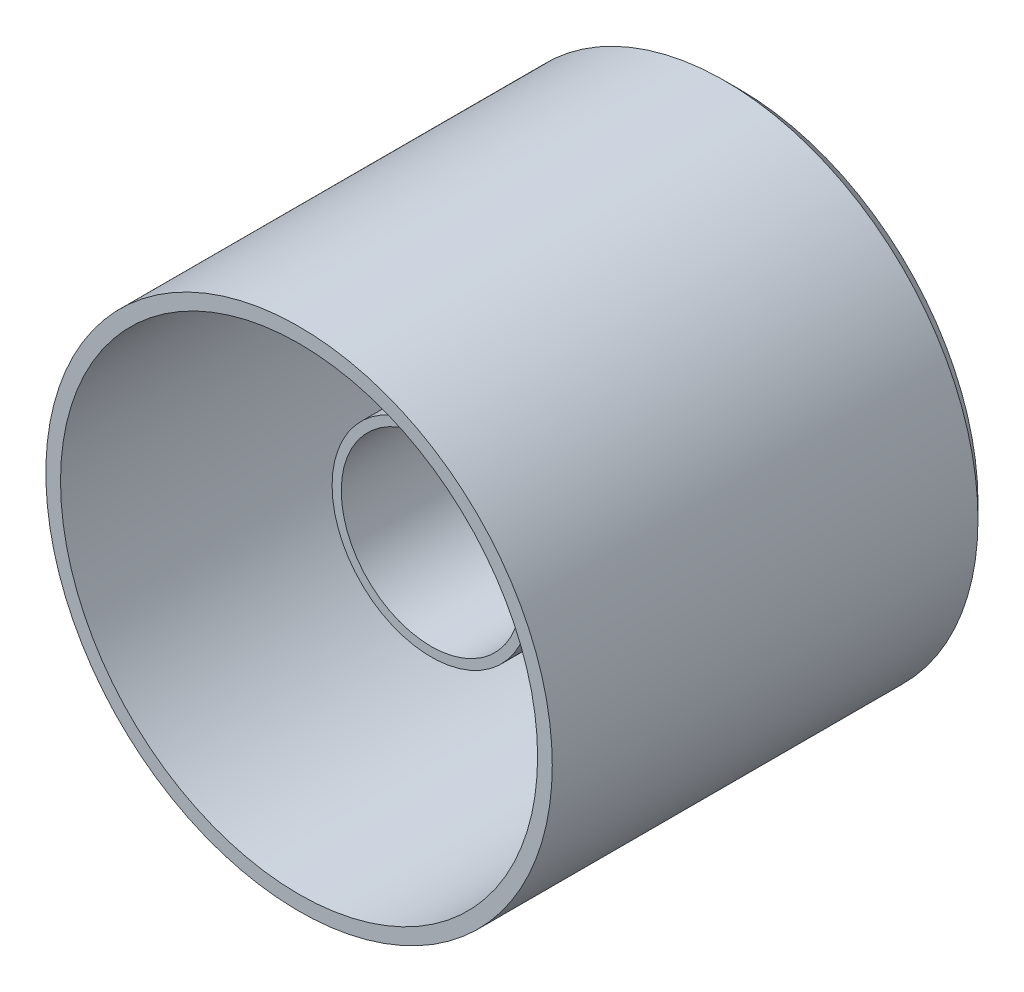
from build123d import *

# Parameters (mm, degrees)
ESQUISSE1_R             = 34.5
BOSS_EXTRU_1_DEPTH      = 60
COQUE1_T                = -2
CHANFREIN1_SIZE         = 2
ESQUISSE2_R             = 12.25
ENL_V_MAT_EXTRU_1_DEPTH = 5
ESQUISSE3_R             = 13.5
ESQUISSE3_R_2           = 12.25
BOSS_EXTRU_2_DEPTH      = 40


with BuildPart() as part:
    # Esquisse1 → Boss.-Extru.1 (new body)
    with BuildSketch(Plane.XY):
        Circle(ESQUISSE1_R)
    extrude(amount=BOSS_EXTRU_1_DEPTH)

    # Coque1
    coque1_openings = [part.faces().sort_by_distance(p)[0] for p in [
        (0, 0, 60),
    ]]
    offset(amount=COQUE1_T, openings=coque1_openings, kind=Kind.INTERSECTION)

    # Chanfrein1
    chanfrein1_edges = [part.edges().sort_by_distance(p)[0] for p in [
        (-34.5, 0, 0),
    ]]
    chamfer(chanfrein1_edges, length=CHANFREIN1_SIZE)

    # Esquisse2 → Enl_v. mat.-Extru.1 (cut)
    with BuildSketch(Plane(origin=(0, 0, 0), x_dir=(-1, 0, 0), z_dir=(0, 0, -1))):
        Circle(ESQUISSE2_R)
    extrude(amount=-ENL_V_MAT_EXTRU_1_DEPTH, mode=Mode.SUBTRACT)

    # Esquisse3 → Boss.-Extru.2 (add)
    with BuildSketch(Plane.XY.offset(2)):
        Circle(ESQUISSE3_R)
        with Locations(Location((0, 0, 0), (0, 0, 180))):
            Circle(ESQUISSE3_R_2, mode=Mode.SUBTRACT)
    extrude(amount=BOSS_EXTRU_2_DEPTH)


solid = part.part
